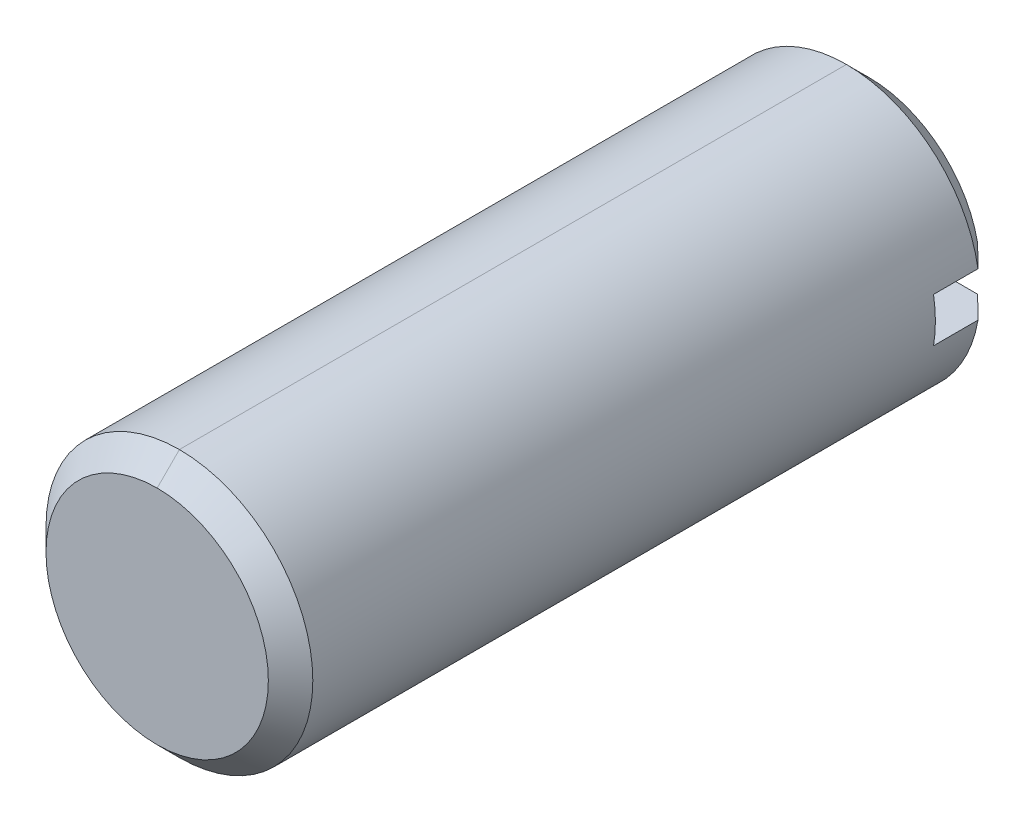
ISO-10303-21;
HEADER;
FILE_DESCRIPTION(('STEP AP214'),'2;1');
FILE_NAME('part.step','',(''),(''),'','','');
FILE_SCHEMA(('AUTOMOTIVE_DESIGN { 1 0 10303 214 1 1 1 1 }'));
ENDSEC;
DATA;
#1=APPLICATION_CONTEXT('core data for automotive mechanical design processes');
#2=APPLICATION_PROTOCOL_DEFINITION('international standard','automotive_design',2000,#1);
#3=PRODUCT_CONTEXT('',#1,'mechanical');
#4=PRODUCT('Part','Part','',(#3));
#5=PRODUCT_RELATED_PRODUCT_CATEGORY('part','',(#4));
#6=PRODUCT_DEFINITION_FORMATION('','',#4);
#7=PRODUCT_DEFINITION_CONTEXT('part definition',#1,'design');
#8=PRODUCT_DEFINITION('design','',#6,#7);
#9=PRODUCT_DEFINITION_SHAPE('','',#8);
#10=(LENGTH_UNIT() NAMED_UNIT(*) SI_UNIT(.MILLI.,.METRE.));
#11=(NAMED_UNIT(*) PLANE_ANGLE_UNIT() SI_UNIT($,.RADIAN.));
#12=(NAMED_UNIT(*) SI_UNIT($,.STERADIAN.) SOLID_ANGLE_UNIT());
#13=UNCERTAINTY_MEASURE_WITH_UNIT(LENGTH_MEASURE(1.E-05),#10,'distance_accuracy_value','');
#14=(GEOMETRIC_REPRESENTATION_CONTEXT(3) GLOBAL_UNCERTAINTY_ASSIGNED_CONTEXT((#13)) GLOBAL_UNIT_ASSIGNED_CONTEXT((#10,
#11,#12)) REPRESENTATION_CONTEXT('',''));
#15=CARTESIAN_POINT('',(0.,0.,0.));
#16=DIRECTION('',(0.,0.,1.));
#17=DIRECTION('',(1.,0.,0.));
#18=AXIS2_PLACEMENT_3D('',#15,#16,#17);
#19=CARTESIAN_POINT('',(127.,0.79375,-10.31875));
#20=DIRECTION('',(0.,0.,1.));
#21=DIRECTION('',(0.,-1.,0.));
#22=AXIS2_PLACEMENT_3D('',#19,#20,#21);
#23=PLANE('',#22);
#24=DIRECTION('',(1.,0.,0.));
#25=VECTOR('',#24,1.);
#26=CARTESIAN_POINT('',(127.,-0.79375,-10.31875));
#27=LINE('',#26,#25);
#28=CARTESIAN_POINT('',(4.6958883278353,-0.79375,-10.31875));
#29=VERTEX_POINT('',#28);
#30=CARTESIAN_POINT('',(-4.69588832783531,-0.79375,-10.31875));
#31=VERTEX_POINT('',#30);
#32=EDGE_CURVE('E99',#29,#31,#27,.F.);
#33=ORIENTED_EDGE('',*,*,#32,.T.);
#34=CARTESIAN_POINT('',(0.,0.,-10.31875));
#35=DIRECTION('',(0.,0.,1.));
#36=DIRECTION('',(0.,-1.,0.));
#37=AXIS2_PLACEMENT_3D('',#34,#35,#36);
#38=CIRCLE('',#37,4.7625);
#39=CARTESIAN_POINT('',(-4.69588832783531,0.79375,-10.31875));
#40=VERTEX_POINT('',#39);
#41=EDGE_CURVE('E19',#40,#31,#38,.T.);
#42=ORIENTED_EDGE('',*,*,#41,.F.);
#43=DIRECTION('',(1.,0.,0.));
#44=VECTOR('',#43,1.);
#45=CARTESIAN_POINT('',(127.,0.79375,-10.31875));
#46=LINE('',#45,#44);
#47=CARTESIAN_POINT('',(4.6958883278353,0.79375,-10.31875));
#48=VERTEX_POINT('',#47);
#49=EDGE_CURVE('E92',#40,#48,#46,.T.);
#50=ORIENTED_EDGE('',*,*,#49,.T.);
#51=CARTESIAN_POINT('',(0.,0.,-10.31875));
#52=DIRECTION('',(0.,0.,1.));
#53=DIRECTION('',(0.,-1.,0.));
#54=AXIS2_PLACEMENT_3D('',#51,#52,#53);
#55=CIRCLE('',#54,4.7625);
#56=EDGE_CURVE('E101',#29,#48,#55,.T.);
#57=ORIENTED_EDGE('',*,*,#56,.F.);
#58=EDGE_LOOP('',(#33,#42,#50,#57));
#59=FACE_BOUND('',#58,.T.);
#60=ADVANCED_FACE('F16',(#59),#23,.F.);
#61=CARTESIAN_POINT('',(127.,-0.79375,-10.31875));
#62=DIRECTION('',(0.,-1.,0.));
#63=DIRECTION('',(0.,0.,-1.));
#64=AXIS2_PLACEMENT_3D('',#61,#62,#63);
#65=PLANE('',#64);
#66=CARTESIAN_POINT('',(3.8885649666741,-0.79375,-12.7000000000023));
#67=CARTESIAN_POINT('',(4.02332625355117,-0.79375,-12.5679192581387));
#68=CARTESIAN_POINT('',(4.15798384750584,-0.79375,-12.4357330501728));
#69=CARTESIAN_POINT('',(4.42709163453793,-0.79375,-12.1711497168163));
#70=CARTESIAN_POINT('',(4.56154182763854,-0.79375,-12.0387525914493));
#71=CARTESIAN_POINT('',(4.69588832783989,-0.79375,-11.9062500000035));
#72=B_SPLINE_CURVE_WITH_KNOTS('',3,(#66,#67,#68,#69,#70,#71),.UNSPECIFIED.,.F.,.F.,(4,2,4),(0.,
0.566085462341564,1.13217086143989),.UNSPECIFIED.);
#73=CARTESIAN_POINT('',(3.88856496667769,-0.79375,-12.6999999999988));
#74=VERTEX_POINT('',#73);
#75=CARTESIAN_POINT('',(4.69588832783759,-0.79375,-11.9062500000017));
#76=VERTEX_POINT('',#75);
#77=EDGE_CURVE('E124',#74,#76,#72,.T.);
#78=ORIENTED_EDGE('',*,*,#77,.F.);
#79=DIRECTION('',(1.,0.,0.));
#80=VECTOR('',#79,1.);
#81=CARTESIAN_POINT('',(0.,-0.79375,-12.7));
#82=LINE('',#81,#80);
#83=CARTESIAN_POINT('',(-3.8885649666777,-0.79375,-12.6999999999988));
#84=VERTEX_POINT('',#83);
#85=EDGE_CURVE('E106',#84,#74,#82,.T.);
#86=ORIENTED_EDGE('',*,*,#85,.F.);
#87=CARTESIAN_POINT('',(-4.69588832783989,-0.79375,-11.9062500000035));
#88=CARTESIAN_POINT('',(-4.56154182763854,-0.79375,-12.0387525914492));
#89=CARTESIAN_POINT('',(-4.42709163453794,-0.79375,-12.1711497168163));
#90=CARTESIAN_POINT('',(-4.15798384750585,-0.79375,-12.4357330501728));
#91=CARTESIAN_POINT('',(-4.02332625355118,-0.79375,-12.5679192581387));
#92=CARTESIAN_POINT('',(-3.8885649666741,-0.79375,-12.7000000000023));
#93=B_SPLINE_CURVE_WITH_KNOTS('',3,(#87,#88,#89,#90,#91,#92),.UNSPECIFIED.,.F.,.F.,(4,2,4),(0.,
0.566085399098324,1.13217086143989),.UNSPECIFIED.);
#94=CARTESIAN_POINT('',(-4.69588832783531,-0.79375,-11.906250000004));
#95=VERTEX_POINT('',#94);
#96=EDGE_CURVE('E130',#95,#84,#93,.T.);
#97=ORIENTED_EDGE('',*,*,#96,.F.);
#98=DIRECTION('',(0.,0.,-1.));
#99=VECTOR('',#98,1.);
#100=CARTESIAN_POINT('',(-4.6958883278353,-0.79375,-10.31875));
#101=LINE('',#100,#99);
#102=EDGE_CURVE('E128',#31,#95,#101,.T.);
#103=ORIENTED_EDGE('',*,*,#102,.F.);
#104=ORIENTED_EDGE('',*,*,#32,.F.);
#105=DIRECTION('',(0.,0.,-1.));
#106=VECTOR('',#105,1.);
#107=CARTESIAN_POINT('',(4.69588832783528,-0.79375,-10.31875));
#108=LINE('',#107,#106);
#109=EDGE_CURVE('E120',#76,#29,#108,.F.);
#110=ORIENTED_EDGE('',*,*,#109,.F.);
#111=EDGE_LOOP('',(#78,#86,#97,#103,#104,#110));
#112=FACE_BOUND('',#111,.T.);
#113=ADVANCED_FACE('F178',(#112),#65,.F.);
#114=CARTESIAN_POINT('',(127.,0.79375,-12.7));
#115=DIRECTION('',(0.,1.,0.));
#116=DIRECTION('',(0.,0.,1.));
#117=AXIS2_PLACEMENT_3D('',#114,#115,#116);
#118=PLANE('',#117);
#119=ORIENTED_EDGE('',*,*,#49,.F.);
#120=DIRECTION('',(0.,0.,1.));
#121=VECTOR('',#120,1.);
#122=CARTESIAN_POINT('',(-4.6958883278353,0.79375,-12.7));
#123=LINE('',#122,#121);
#124=CARTESIAN_POINT('',(-4.6958883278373,0.79375,-11.906250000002));
#125=VERTEX_POINT('',#124);
#126=EDGE_CURVE('E84',#125,#40,#123,.T.);
#127=ORIENTED_EDGE('',*,*,#126,.F.);
#128=CARTESIAN_POINT('',(-3.8885649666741,0.79375,-12.7000000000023));
#129=CARTESIAN_POINT('',(-4.02332625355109,0.79375,-12.5679192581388));
#130=CARTESIAN_POINT('',(-4.15798384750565,0.79375,-12.435733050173));
#131=CARTESIAN_POINT('',(-4.42709163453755,0.79375,-12.1711497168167));
#132=CARTESIAN_POINT('',(-4.56154182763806,0.79375,-12.0387525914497));
#133=CARTESIAN_POINT('',(-4.69588832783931,0.79375,-11.9062500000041));
#134=B_SPLINE_CURVE_WITH_KNOTS('',3,(#128,#129,#130,#131,#132,#133),.UNSPECIFIED.,.F.,.F.,(4,2,
4),(0.,0.566085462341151,1.13217086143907),.UNSPECIFIED.);
#135=CARTESIAN_POINT('',(-3.8885649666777,0.79375,-12.6999999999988));
#136=VERTEX_POINT('',#135);
#137=EDGE_CURVE('E93',#136,#125,#134,.T.);
#138=ORIENTED_EDGE('',*,*,#137,.F.);
#139=DIRECTION('',(1.,0.,0.));
#140=VECTOR('',#139,1.);
#141=CARTESIAN_POINT('',(0.,0.79375,-12.7));
#142=LINE('',#141,#140);
#143=CARTESIAN_POINT('',(3.8885649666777,0.79375,-12.6999999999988));
#144=VERTEX_POINT('',#143);
#145=EDGE_CURVE('E218',#144,#136,#142,.F.);
#146=ORIENTED_EDGE('',*,*,#145,.F.);
#147=CARTESIAN_POINT('',(4.69588832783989,0.79375,-11.9062500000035));
#148=CARTESIAN_POINT('',(4.56154182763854,0.79375,-12.0387525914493));
#149=CARTESIAN_POINT('',(4.42709163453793,0.79375,-12.1711497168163));
#150=CARTESIAN_POINT('',(4.15798384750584,0.79375,-12.4357330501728));
#151=CARTESIAN_POINT('',(4.02332625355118,0.79375,-12.5679192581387));
#152=CARTESIAN_POINT('',(3.8885649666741,0.79375,-12.7000000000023));
#153=B_SPLINE_CURVE_WITH_KNOTS('',3,(#147,#148,#149,#150,#151,#152),.UNSPECIFIED.,.F.,.F.,(4,2,
4),(0.,0.566085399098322,1.13217086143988),.UNSPECIFIED.);
#154=CARTESIAN_POINT('',(4.6958883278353,0.79375,-11.906250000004));
#155=VERTEX_POINT('',#154);
#156=EDGE_CURVE('E123',#155,#144,#153,.T.);
#157=ORIENTED_EDGE('',*,*,#156,.F.);
#158=DIRECTION('',(0.,0.,1.));
#159=VECTOR('',#158,1.);
#160=CARTESIAN_POINT('',(4.69588832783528,0.79375,-12.7));
#161=LINE('',#160,#159);
#162=EDGE_CURVE('E104',#48,#155,#161,.F.);
#163=ORIENTED_EDGE('',*,*,#162,.F.);
#164=EDGE_LOOP('',(#119,#127,#138,#146,#157,#163));
#165=FACE_BOUND('',#164,.T.);
#166=ADVANCED_FACE('F102',(#165),#118,.F.);
#167=CARTESIAN_POINT('',(0.,-2.38125,-12.7));
#168=DIRECTION('',(0.,0.,-1.));
#169=DIRECTION('',(0.,1.,0.));
#170=AXIS2_PLACEMENT_3D('',#167,#168,#169);
#171=PLANE('',#170);
#172=ORIENTED_EDGE('',*,*,#85,.T.);
#173=CARTESIAN_POINT('',(0.,0.,-12.6999999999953));
#174=DIRECTION('',(0.,0.,1.));
#175=DIRECTION('',(1.,0.,0.));
#176=AXIS2_PLACEMENT_3D('',#173,#174,#175);
#177=CIRCLE('',#176,3.96875000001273);
#178=EDGE_CURVE('E137',#84,#74,#177,.T.);
#179=ORIENTED_EDGE('',*,*,#178,.F.);
#180=EDGE_LOOP('',(#172,#179));
#181=FACE_BOUND('',#180,.T.);
#182=ADVANCED_FACE('F188',(#181),#171,.T.);
#183=CARTESIAN_POINT('',(0.,-2.38125,-12.7));
#184=DIRECTION('',(0.,0.,-1.));
#185=DIRECTION('',(0.,1.,0.));
#186=AXIS2_PLACEMENT_3D('',#183,#184,#185);
#187=PLANE('',#186);
#188=ORIENTED_EDGE('',*,*,#145,.T.);
#189=CARTESIAN_POINT('',(0.,0.,-12.6999999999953));
#190=DIRECTION('',(0.,0.,1.));
#191=DIRECTION('',(1.,0.,0.));
#192=AXIS2_PLACEMENT_3D('',#189,#190,#191);
#193=CIRCLE('',#192,3.96875000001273);
#194=EDGE_CURVE('E134',#144,#136,#193,.T.);
#195=ORIENTED_EDGE('',*,*,#194,.F.);
#196=EDGE_LOOP('',(#188,#195));
#197=FACE_BOUND('',#196,.T.);
#198=ADVANCED_FACE('F239',(#197),#187,.T.);
#199=CARTESIAN_POINT('',(0.,0.,11.9062500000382));
#200=DIRECTION('',(0.,0.,-1.));
#201=DIRECTION('',(-1.,0.,0.));
#202=AXIS2_PLACEMENT_3D('',#199,#200,#201);
#203=CONICAL_SURFACE('',#202,4.7624999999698,0.785398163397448);
#204=DIRECTION('',(0.,-0.707106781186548,0.707106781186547));
#205=VECTOR('',#204,1.);
#206=CARTESIAN_POINT('',(-6.11075045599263E-11,499000.,-498983.33125));
#207=LINE('',#206,#205);
#208=CARTESIAN_POINT('',(0.,3.96874999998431,12.6999999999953));
#209=VERTEX_POINT('',#208);
#210=CARTESIAN_POINT('',(0.,4.76249999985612,11.906250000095));
#211=VERTEX_POINT('',#210);
#212=EDGE_CURVE('E34',#209,#211,#207,.F.);
#213=ORIENTED_EDGE('',*,*,#212,.T.);
#214=CARTESIAN_POINT('',(0.,0.,11.90625));
#215=DIRECTION('',(0.,0.,1.));
#216=DIRECTION('',(0.,-1.,0.));
#217=AXIS2_PLACEMENT_3D('',#214,#215,#216);
#218=CIRCLE('',#217,4.7625);
#219=CARTESIAN_POINT('',(0.,-4.76250000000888,11.9062499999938));
#220=VERTEX_POINT('',#219);
#221=EDGE_CURVE('E112',#220,#211,#218,.F.);
#222=ORIENTED_EDGE('',*,*,#221,.F.);
#223=DIRECTION('',(0.,0.707106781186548,0.707106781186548));
#224=VECTOR('',#223,1.);
#225=CARTESIAN_POINT('',(0.,-499000.,-498983.33125));
#226=LINE('',#225,#224);
#227=CARTESIAN_POINT('',(0.,-3.96875000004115,12.6999999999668));
#228=VERTEX_POINT('',#227);
#229=EDGE_CURVE('E221',#220,#228,#226,.T.);
#230=ORIENTED_EDGE('',*,*,#229,.T.);
#231=CARTESIAN_POINT('',(0.,0.,12.6999999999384));
#232=DIRECTION('',(0.,0.,-1.));
#233=DIRECTION('',(-1.,0.,0.));
#234=AXIS2_PLACEMENT_3D('',#231,#232,#233);
#235=CIRCLE('',#234,3.96875000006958);
#236=EDGE_CURVE('E140',#209,#228,#235,.F.);
#237=ORIENTED_EDGE('',*,*,#236,.F.);
#238=EDGE_LOOP('',(#213,#222,#230,#237));
#239=FACE_BOUND('',#238,.T.);
#240=ADVANCED_FACE('F232',(#239),#203,.T.);
#241=CARTESIAN_POINT('',(0.,-1.984375,12.7));
#242=DIRECTION('',(0.,0.,1.));
#243=DIRECTION('',(0.,-1.,0.));
#244=AXIS2_PLACEMENT_3D('',#241,#242,#243);
#245=PLANE('',#244);
#246=CARTESIAN_POINT('',(0.,0.,12.7000000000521));
#247=DIRECTION('',(0.,0.,-1.));
#248=DIRECTION('',(-1.,0.,0.));
#249=AXIS2_PLACEMENT_3D('',#246,#247,#248);
#250=CIRCLE('',#249,3.96874999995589);
#251=EDGE_CURVE('E127',#209,#228,#250,.T.);
#252=ORIENTED_EDGE('',*,*,#251,.F.);
#253=ORIENTED_EDGE('',*,*,#236,.T.);
#254=EDGE_LOOP('',(#252,#253));
#255=FACE_BOUND('',#254,.T.);
#256=ADVANCED_FACE('F167',(#255),#245,.T.);
#257=CARTESIAN_POINT('',(0.,0.,-11.9062500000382));
#258=DIRECTION('',(0.,0.,1.));
#259=DIRECTION('',(1.,0.,0.));
#260=AXIS2_PLACEMENT_3D('',#257,#258,#259);
#261=CONICAL_SURFACE('',#260,4.7624999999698,0.785398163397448);
#262=ORIENTED_EDGE('',*,*,#96,.T.);
#263=ORIENTED_EDGE('',*,*,#178,.T.);
#264=ORIENTED_EDGE('',*,*,#77,.T.);
#265=CARTESIAN_POINT('',(0.,0.,-11.90625));
#266=DIRECTION('',(0.,0.,1.));
#267=DIRECTION('',(0.,-1.,0.));
#268=AXIS2_PLACEMENT_3D('',#265,#266,#267);
#269=CIRCLE('',#268,4.7625);
#270=CARTESIAN_POINT('',(0.,-4.76250000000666,-11.9062499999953));
#271=VERTEX_POINT('',#270);
#272=EDGE_CURVE('E116',#271,#76,#269,.T.);
#273=ORIENTED_EDGE('',*,*,#272,.F.);
#274=CARTESIAN_POINT('',(0.,0.,-11.90625));
#275=DIRECTION('',(0.,0.,1.));
#276=DIRECTION('',(0.,-1.,0.));
#277=AXIS2_PLACEMENT_3D('',#274,#275,#276);
#278=CIRCLE('',#277,4.7625);
#279=EDGE_CURVE('E111',#95,#271,#278,.T.);
#280=ORIENTED_EDGE('',*,*,#279,.F.);
#281=EDGE_LOOP('',(#262,#263,#264,#273,#280));
#282=FACE_BOUND('',#281,.T.);
#283=ADVANCED_FACE('F160',(#282),#261,.T.);
#284=CARTESIAN_POINT('',(0.,0.,-11.9062500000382));
#285=DIRECTION('',(0.,0.,1.));
#286=DIRECTION('',(1.,0.,0.));
#287=AXIS2_PLACEMENT_3D('',#284,#285,#286);
#288=CONICAL_SURFACE('',#287,4.7624999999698,0.785398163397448);
#289=ORIENTED_EDGE('',*,*,#156,.T.);
#290=ORIENTED_EDGE('',*,*,#194,.T.);
#291=ORIENTED_EDGE('',*,*,#137,.T.);
#292=CARTESIAN_POINT('',(0.,0.,-11.90625));
#293=DIRECTION('',(0.,0.,1.));
#294=DIRECTION('',(0.,-1.,0.));
#295=AXIS2_PLACEMENT_3D('',#292,#293,#294);
#296=CIRCLE('',#295,4.7625);
#297=CARTESIAN_POINT('',(0.,4.76250000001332,-11.9062499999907));
#298=VERTEX_POINT('',#297);
#299=EDGE_CURVE('E89',#298,#125,#296,.T.);
#300=ORIENTED_EDGE('',*,*,#299,.F.);
#301=CARTESIAN_POINT('',(0.,0.,-11.90625));
#302=DIRECTION('',(0.,0.,1.));
#303=DIRECTION('',(0.,-1.,0.));
#304=AXIS2_PLACEMENT_3D('',#301,#302,#303);
#305=CIRCLE('',#304,4.7625);
#306=EDGE_CURVE('E113',#155,#298,#305,.T.);
#307=ORIENTED_EDGE('',*,*,#306,.F.);
#308=EDGE_LOOP('',(#289,#290,#291,#300,#307));
#309=FACE_BOUND('',#308,.T.);
#310=ADVANCED_FACE('F155',(#309),#288,.T.);
#311=CARTESIAN_POINT('',(0.,0.,0.));
#312=DIRECTION('',(0.,0.,1.));
#313=DIRECTION('',(0.,-1.,0.));
#314=AXIS2_PLACEMENT_3D('',#311,#312,#313);
#315=CYLINDRICAL_SURFACE('',#314,4.7625);
#316=ORIENTED_EDGE('',*,*,#102,.T.);
#317=ORIENTED_EDGE('',*,*,#279,.T.);
#318=DIRECTION('',(0.,0.,1.));
#319=VECTOR('',#318,1.);
#320=CARTESIAN_POINT('',(0.,-4.7625,0.));
#321=LINE('',#320,#319);
#322=EDGE_CURVE('E119',#220,#271,#321,.F.);
#323=ORIENTED_EDGE('',*,*,#322,.F.);
#324=ORIENTED_EDGE('',*,*,#221,.T.);
#325=DIRECTION('',(0.,0.,1.));
#326=VECTOR('',#325,1.);
#327=CARTESIAN_POINT('',(0.,4.7625,0.));
#328=LINE('',#327,#326);
#329=EDGE_CURVE('E25',#298,#211,#328,.T.);
#330=ORIENTED_EDGE('',*,*,#329,.F.);
#331=ORIENTED_EDGE('',*,*,#299,.T.);
#332=ORIENTED_EDGE('',*,*,#126,.T.);
#333=ORIENTED_EDGE('',*,*,#41,.T.);
#334=EDGE_LOOP('',(#316,#317,#323,#324,#330,#331,#332,#333));
#335=FACE_BOUND('',#334,.T.);
#336=ADVANCED_FACE('F86',(#335),#315,.T.);
#337=CARTESIAN_POINT('',(0.,0.,11.9062500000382));
#338=DIRECTION('',(0.,0.,-1.));
#339=DIRECTION('',(-1.,0.,0.));
#340=AXIS2_PLACEMENT_3D('',#337,#338,#339);
#341=CONICAL_SURFACE('',#340,4.7624999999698,0.785398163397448);
#342=ORIENTED_EDGE('',*,*,#212,.F.);
#343=ORIENTED_EDGE('',*,*,#251,.T.);
#344=ORIENTED_EDGE('',*,*,#229,.F.);
#345=CARTESIAN_POINT('',(0.,0.,11.90625));
#346=DIRECTION('',(0.,0.,1.));
#347=DIRECTION('',(0.,-1.,0.));
#348=AXIS2_PLACEMENT_3D('',#345,#346,#347);
#349=CIRCLE('',#348,4.7625);
#350=EDGE_CURVE('E11',#211,#220,#349,.F.);
#351=ORIENTED_EDGE('',*,*,#350,.F.);
#352=EDGE_LOOP('',(#342,#343,#344,#351));
#353=FACE_BOUND('',#352,.T.);
#354=ADVANCED_FACE('F191',(#353),#341,.T.);
#355=CARTESIAN_POINT('',(0.,0.,0.));
#356=DIRECTION('',(0.,0.,1.));
#357=DIRECTION('',(0.,-1.,0.));
#358=AXIS2_PLACEMENT_3D('',#355,#356,#357);
#359=CYLINDRICAL_SURFACE('',#358,4.7625);
#360=ORIENTED_EDGE('',*,*,#329,.T.);
#361=ORIENTED_EDGE('',*,*,#350,.T.);
#362=ORIENTED_EDGE('',*,*,#322,.T.);
#363=ORIENTED_EDGE('',*,*,#272,.T.);
#364=ORIENTED_EDGE('',*,*,#109,.T.);
#365=ORIENTED_EDGE('',*,*,#56,.T.);
#366=ORIENTED_EDGE('',*,*,#162,.T.);
#367=ORIENTED_EDGE('',*,*,#306,.T.);
#368=EDGE_LOOP('',(#360,#361,#362,#363,#364,#365,#366,#367));
#369=FACE_BOUND('',#368,.T.);
#370=ADVANCED_FACE('F189',(#369),#359,.T.);
#371=CLOSED_SHELL('',(#60,#113,#166,#182,#198,#240,#256,#283,#310,#336,#354,#370));
#372=MANIFOLD_SOLID_BREP('B1',#371);
#373=ADVANCED_BREP_SHAPE_REPRESENTATION('',(#18,#372),#14);
#374=SHAPE_DEFINITION_REPRESENTATION(#9,#373);
ENDSEC;
END-ISO-10303-21;
